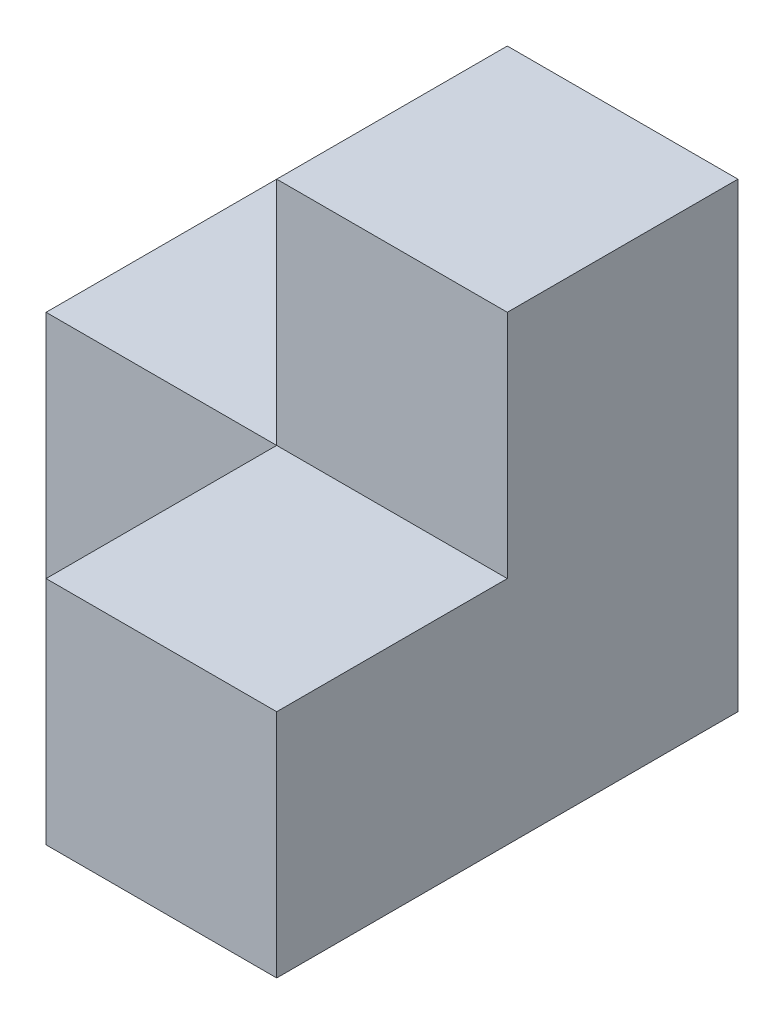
ISO-10303-21;
HEADER;
FILE_DESCRIPTION(('STEP AP214'),'2;1');
FILE_NAME('part.step','',(''),(''),'','','');
FILE_SCHEMA(('AUTOMOTIVE_DESIGN { 1 0 10303 214 1 1 1 1 }'));
ENDSEC;
DATA;
#1=APPLICATION_CONTEXT('core data for automotive mechanical design processes');
#2=APPLICATION_PROTOCOL_DEFINITION('international standard','automotive_design',2000,#1);
#3=PRODUCT_CONTEXT('',#1,'mechanical');
#4=PRODUCT('Part','Part','',(#3));
#5=PRODUCT_RELATED_PRODUCT_CATEGORY('part','',(#4));
#6=PRODUCT_DEFINITION_FORMATION('','',#4);
#7=PRODUCT_DEFINITION_CONTEXT('part definition',#1,'design');
#8=PRODUCT_DEFINITION('design','',#6,#7);
#9=PRODUCT_DEFINITION_SHAPE('','',#8);
#10=(LENGTH_UNIT() NAMED_UNIT(*) SI_UNIT(.MILLI.,.METRE.));
#11=(NAMED_UNIT(*) PLANE_ANGLE_UNIT() SI_UNIT($,.RADIAN.));
#12=(NAMED_UNIT(*) SI_UNIT($,.STERADIAN.) SOLID_ANGLE_UNIT());
#13=UNCERTAINTY_MEASURE_WITH_UNIT(LENGTH_MEASURE(1.E-05),#10,'distance_accuracy_value','');
#14=(GEOMETRIC_REPRESENTATION_CONTEXT(3) GLOBAL_UNCERTAINTY_ASSIGNED_CONTEXT((#13)) GLOBAL_UNIT_ASSIGNED_CONTEXT((#10,
#11,#12)) REPRESENTATION_CONTEXT('',''));
#15=CARTESIAN_POINT('',(0.,0.,0.));
#16=DIRECTION('',(0.,0.,1.));
#17=DIRECTION('',(1.,0.,0.));
#18=AXIS2_PLACEMENT_3D('',#15,#16,#17);
#19=CARTESIAN_POINT('',(0.,76.2,0.));
#20=DIRECTION('',(0.,1.,0.));
#21=DIRECTION('',(0.,0.,1.));
#22=AXIS2_PLACEMENT_3D('',#19,#20,#21);
#23=PLANE('',#22);
#24=DIRECTION('',(1.,0.,0.));
#25=VECTOR('',#24,1.);
#26=CARTESIAN_POINT('',(0.,76.2,76.2));
#27=LINE('',#26,#25);
#28=CARTESIAN_POINT('',(-76.2,76.2,76.2));
#29=VERTEX_POINT('',#28);
#30=CARTESIAN_POINT('',(0.,76.2,76.2000000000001));
#31=VERTEX_POINT('',#30);
#32=EDGE_CURVE('E127',#29,#31,#27,.T.);
#33=ORIENTED_EDGE('',*,*,#32,.F.);
#34=DIRECTION('',(0.,0.,1.));
#35=VECTOR('',#34,1.);
#36=CARTESIAN_POINT('',(-76.2,76.2,76.2));
#37=LINE('',#36,#35);
#38=CARTESIAN_POINT('',(-76.2,76.2,152.4));
#39=VERTEX_POINT('',#38);
#40=EDGE_CURVE('E161',#29,#39,#37,.T.);
#41=ORIENTED_EDGE('',*,*,#40,.T.);
#42=DIRECTION('',(1.,0.,0.));
#43=VECTOR('',#42,1.);
#44=CARTESIAN_POINT('',(-76.2,76.2,152.4));
#45=LINE('',#44,#43);
#46=CARTESIAN_POINT('',(0.,76.2,152.4));
#47=VERTEX_POINT('',#46);
#48=EDGE_CURVE('E163',#39,#47,#45,.T.);
#49=ORIENTED_EDGE('',*,*,#48,.T.);
#50=DIRECTION('',(0.,0.,-1.));
#51=VECTOR('',#50,1.);
#52=CARTESIAN_POINT('',(0.,76.2,152.4));
#53=LINE('',#52,#51);
#54=EDGE_CURVE('E59',#47,#31,#53,.T.);
#55=ORIENTED_EDGE('',*,*,#54,.T.);
#56=EDGE_LOOP('',(#33,#41,#49,#55));
#57=FACE_BOUND('',#56,.T.);
#58=ADVANCED_FACE('F34',(#57),#23,.T.);
#59=CARTESIAN_POINT('',(0.,76.2,152.4));
#60=DIRECTION('',(-1.,0.,0.));
#61=DIRECTION('',(0.,0.,1.));
#62=AXIS2_PLACEMENT_3D('',#59,#60,#61);
#63=PLANE('',#62);
#64=DIRECTION('',(0.,0.,-1.));
#65=VECTOR('',#64,1.);
#66=CARTESIAN_POINT('',(0.,0.,152.4));
#67=LINE('',#66,#65);
#68=CARTESIAN_POINT('',(0.,0.,152.4));
#69=VERTEX_POINT('',#68);
#70=CARTESIAN_POINT('',(0.,0.,0.));
#71=VERTEX_POINT('',#70);
#72=EDGE_CURVE('E112',#69,#71,#67,.T.);
#73=ORIENTED_EDGE('',*,*,#72,.T.);
#74=DIRECTION('',(0.,-1.,0.));
#75=VECTOR('',#74,1.);
#76=CARTESIAN_POINT('',(0.,76.2,0.));
#77=LINE('',#76,#75);
#78=CARTESIAN_POINT('',(0.,152.4,0.));
#79=VERTEX_POINT('',#78);
#80=EDGE_CURVE('E11',#79,#71,#77,.T.);
#81=ORIENTED_EDGE('',*,*,#80,.F.);
#82=DIRECTION('',(0.,0.,-1.));
#83=VECTOR('',#82,1.);
#84=CARTESIAN_POINT('',(0.,152.4,0.));
#85=LINE('',#84,#83);
#86=CARTESIAN_POINT('',(0.,152.4,76.2));
#87=VERTEX_POINT('',#86);
#88=EDGE_CURVE('E109',#87,#79,#85,.T.);
#89=ORIENTED_EDGE('',*,*,#88,.F.);
#90=DIRECTION('',(0.,-1.,0.));
#91=VECTOR('',#90,1.);
#92=CARTESIAN_POINT('',(0.,152.4,76.2));
#93=LINE('',#92,#91);
#94=EDGE_CURVE('E133',#87,#31,#93,.T.);
#95=ORIENTED_EDGE('',*,*,#94,.T.);
#96=ORIENTED_EDGE('',*,*,#54,.F.);
#97=DIRECTION('',(0.,-1.,0.));
#98=VECTOR('',#97,1.);
#99=CARTESIAN_POINT('',(0.,76.2,152.4));
#100=LINE('',#99,#98);
#101=EDGE_CURVE('E164',#47,#69,#100,.T.);
#102=ORIENTED_EDGE('',*,*,#101,.T.);
#103=EDGE_LOOP('',(#73,#81,#89,#95,#96,#102));
#104=FACE_BOUND('',#103,.T.);
#105=ADVANCED_FACE('F36',(#104),#63,.F.);
#106=CARTESIAN_POINT('',(0.,76.2,0.));
#107=DIRECTION('',(0.,0.,1.));
#108=DIRECTION('',(1.,0.,0.));
#109=AXIS2_PLACEMENT_3D('',#106,#107,#108);
#110=PLANE('',#109);
#111=DIRECTION('',(-1.,0.,0.));
#112=VECTOR('',#111,1.);
#113=CARTESIAN_POINT('',(0.,0.,0.));
#114=LINE('',#113,#112);
#115=CARTESIAN_POINT('',(-152.4,0.,0.));
#116=VERTEX_POINT('',#115);
#117=EDGE_CURVE('E145',#71,#116,#114,.T.);
#118=ORIENTED_EDGE('',*,*,#117,.T.);
#119=DIRECTION('',(0.,-1.,0.));
#120=VECTOR('',#119,1.);
#121=CARTESIAN_POINT('',(-152.4,76.2,0.));
#122=LINE('',#121,#120);
#123=CARTESIAN_POINT('',(-152.4,76.2,0.));
#124=VERTEX_POINT('',#123);
#125=EDGE_CURVE('E43',#124,#116,#122,.T.);
#126=ORIENTED_EDGE('',*,*,#125,.F.);
#127=DIRECTION('',(-1.,0.,0.));
#128=VECTOR('',#127,1.);
#129=CARTESIAN_POINT('',(0.,76.2,0.));
#130=LINE('',#129,#128);
#131=CARTESIAN_POINT('',(-76.1999999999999,76.2,0.));
#132=VERTEX_POINT('',#131);
#133=EDGE_CURVE('E151',#132,#124,#130,.T.);
#134=ORIENTED_EDGE('',*,*,#133,.F.);
#135=DIRECTION('',(0.,-1.,0.));
#136=VECTOR('',#135,1.);
#137=CARTESIAN_POINT('',(-76.2,152.4,0.));
#138=LINE('',#137,#136);
#139=CARTESIAN_POINT('',(-76.2,152.4,0.));
#140=VERTEX_POINT('',#139);
#141=EDGE_CURVE('E118',#140,#132,#138,.T.);
#142=ORIENTED_EDGE('',*,*,#141,.F.);
#143=DIRECTION('',(-1.,0.,0.));
#144=VECTOR('',#143,1.);
#145=CARTESIAN_POINT('',(0.,152.4,0.));
#146=LINE('',#145,#144);
#147=EDGE_CURVE('E115',#79,#140,#146,.T.);
#148=ORIENTED_EDGE('',*,*,#147,.F.);
#149=ORIENTED_EDGE('',*,*,#80,.T.);
#150=EDGE_LOOP('',(#118,#126,#134,#142,#148,#149));
#151=FACE_BOUND('',#150,.T.);
#152=ADVANCED_FACE('F116',(#151),#110,.F.);
#153=CARTESIAN_POINT('',(-152.4,76.2,0.));
#154=DIRECTION('',(1.,0.,0.));
#155=DIRECTION('',(0.,0.,-1.));
#156=AXIS2_PLACEMENT_3D('',#153,#154,#155);
#157=PLANE('',#156);
#158=DIRECTION('',(0.,0.,1.));
#159=VECTOR('',#158,1.);
#160=CARTESIAN_POINT('',(-152.4,0.,0.));
#161=LINE('',#160,#159);
#162=CARTESIAN_POINT('',(-152.4,0.,76.2));
#163=VERTEX_POINT('',#162);
#164=EDGE_CURVE('E167',#116,#163,#161,.T.);
#165=ORIENTED_EDGE('',*,*,#164,.T.);
#166=DIRECTION('',(0.,-1.,0.));
#167=VECTOR('',#166,1.);
#168=CARTESIAN_POINT('',(-152.4,76.2,76.2));
#169=LINE('',#168,#167);
#170=CARTESIAN_POINT('',(-152.4,76.2,76.2));
#171=VERTEX_POINT('',#170);
#172=EDGE_CURVE('E182',#171,#163,#169,.T.);
#173=ORIENTED_EDGE('',*,*,#172,.F.);
#174=DIRECTION('',(0.,0.,1.));
#175=VECTOR('',#174,1.);
#176=CARTESIAN_POINT('',(-152.4,76.2,0.));
#177=LINE('',#176,#175);
#178=EDGE_CURVE('E154',#124,#171,#177,.T.);
#179=ORIENTED_EDGE('',*,*,#178,.F.);
#180=ORIENTED_EDGE('',*,*,#125,.T.);
#181=EDGE_LOOP('',(#165,#173,#179,#180));
#182=FACE_BOUND('',#181,.T.);
#183=ADVANCED_FACE('F190',(#182),#157,.F.);
#184=CARTESIAN_POINT('',(-152.4,76.2,76.2));
#185=DIRECTION('',(0.,0.,-1.));
#186=DIRECTION('',(-1.,0.,0.));
#187=AXIS2_PLACEMENT_3D('',#184,#185,#186);
#188=PLANE('',#187);
#189=DIRECTION('',(1.,0.,0.));
#190=VECTOR('',#189,1.);
#191=CARTESIAN_POINT('',(-152.4,0.,76.2));
#192=LINE('',#191,#190);
#193=CARTESIAN_POINT('',(-76.2,0.,76.2));
#194=VERTEX_POINT('',#193);
#195=EDGE_CURVE('E169',#163,#194,#192,.T.);
#196=ORIENTED_EDGE('',*,*,#195,.T.);
#197=DIRECTION('',(0.,-1.,0.));
#198=VECTOR('',#197,1.);
#199=CARTESIAN_POINT('',(-76.2,76.2,76.2));
#200=LINE('',#199,#198);
#201=EDGE_CURVE('E179',#29,#194,#200,.T.);
#202=ORIENTED_EDGE('',*,*,#201,.F.);
#203=DIRECTION('',(1.,0.,0.));
#204=VECTOR('',#203,1.);
#205=CARTESIAN_POINT('',(-152.4,76.2,76.2));
#206=LINE('',#205,#204);
#207=EDGE_CURVE('E159',#171,#29,#206,.T.);
#208=ORIENTED_EDGE('',*,*,#207,.F.);
#209=ORIENTED_EDGE('',*,*,#172,.T.);
#210=EDGE_LOOP('',(#196,#202,#208,#209));
#211=FACE_BOUND('',#210,.T.);
#212=ADVANCED_FACE('F199',(#211),#188,.F.);
#213=CARTESIAN_POINT('',(-76.2,76.2,76.2));
#214=DIRECTION('',(1.,0.,0.));
#215=DIRECTION('',(0.,0.,-1.));
#216=AXIS2_PLACEMENT_3D('',#213,#214,#215);
#217=PLANE('',#216);
#218=DIRECTION('',(0.,0.,1.));
#219=VECTOR('',#218,1.);
#220=CARTESIAN_POINT('',(-76.2,0.,76.2));
#221=LINE('',#220,#219);
#222=CARTESIAN_POINT('',(-76.2,0.,152.4));
#223=VERTEX_POINT('',#222);
#224=EDGE_CURVE('E171',#194,#223,#221,.T.);
#225=ORIENTED_EDGE('',*,*,#224,.T.);
#226=DIRECTION('',(0.,-1.,0.));
#227=VECTOR('',#226,1.);
#228=CARTESIAN_POINT('',(-76.2,76.2,152.4));
#229=LINE('',#228,#227);
#230=EDGE_CURVE('E176',#39,#223,#229,.T.);
#231=ORIENTED_EDGE('',*,*,#230,.F.);
#232=ORIENTED_EDGE('',*,*,#40,.F.);
#233=ORIENTED_EDGE('',*,*,#201,.T.);
#234=EDGE_LOOP('',(#225,#231,#232,#233));
#235=FACE_BOUND('',#234,.T.);
#236=ADVANCED_FACE('F202',(#235),#217,.F.);
#237=CARTESIAN_POINT('',(-76.2,76.2,152.4));
#238=DIRECTION('',(0.,0.,-1.));
#239=DIRECTION('',(-1.,0.,0.));
#240=AXIS2_PLACEMENT_3D('',#237,#238,#239);
#241=PLANE('',#240);
#242=DIRECTION('',(1.,0.,0.));
#243=VECTOR('',#242,1.);
#244=CARTESIAN_POINT('',(-76.2,0.,152.4));
#245=LINE('',#244,#243);
#246=EDGE_CURVE('E173',#223,#69,#245,.T.);
#247=ORIENTED_EDGE('',*,*,#246,.T.);
#248=ORIENTED_EDGE('',*,*,#101,.F.);
#249=ORIENTED_EDGE('',*,*,#48,.F.);
#250=ORIENTED_EDGE('',*,*,#230,.T.);
#251=EDGE_LOOP('',(#247,#248,#249,#250));
#252=FACE_BOUND('',#251,.T.);
#253=ADVANCED_FACE('F224',(#252),#241,.F.);
#254=DIRECTION('',(0.,0.,1.));
#255=VECTOR('',#254,1.);
#256=CARTESIAN_POINT('',(-76.2,76.2,0.));
#257=LINE('',#256,#255);
#258=EDGE_CURVE('E51',#132,#29,#257,.T.);
#259=ORIENTED_EDGE('',*,*,#258,.F.);
#260=ORIENTED_EDGE('',*,*,#133,.T.);
#261=ORIENTED_EDGE('',*,*,#178,.T.);
#262=ORIENTED_EDGE('',*,*,#207,.T.);
#263=EDGE_LOOP('',(#259,#260,#261,#262));
#264=FACE_BOUND('',#263,.T.);
#265=ADVANCED_FACE('F218',(#264),#23,.T.);
#266=CARTESIAN_POINT('',(0.,0.,0.));
#267=DIRECTION('',(0.,1.,0.));
#268=DIRECTION('',(0.,0.,1.));
#269=AXIS2_PLACEMENT_3D('',#266,#267,#268);
#270=PLANE('',#269);
#271=ORIENTED_EDGE('',*,*,#72,.F.);
#272=ORIENTED_EDGE('',*,*,#246,.F.);
#273=ORIENTED_EDGE('',*,*,#224,.F.);
#274=ORIENTED_EDGE('',*,*,#195,.F.);
#275=ORIENTED_EDGE('',*,*,#164,.F.);
#276=ORIENTED_EDGE('',*,*,#117,.F.);
#277=EDGE_LOOP('',(#271,#272,#273,#274,#275,#276));
#278=FACE_BOUND('',#277,.T.);
#279=ADVANCED_FACE('F194',(#278),#270,.F.);
#280=CARTESIAN_POINT('',(-76.2,152.4,0.));
#281=DIRECTION('',(1.,0.,0.));
#282=DIRECTION('',(0.,0.,-1.));
#283=AXIS2_PLACEMENT_3D('',#280,#281,#282);
#284=PLANE('',#283);
#285=ORIENTED_EDGE('',*,*,#258,.T.);
#286=DIRECTION('',(0.,-1.,0.));
#287=VECTOR('',#286,1.);
#288=CARTESIAN_POINT('',(-76.2,152.4,76.2));
#289=LINE('',#288,#287);
#290=CARTESIAN_POINT('',(-76.2,152.4,76.2));
#291=VERTEX_POINT('',#290);
#292=EDGE_CURVE('E136',#291,#29,#289,.T.);
#293=ORIENTED_EDGE('',*,*,#292,.F.);
#294=DIRECTION('',(0.,0.,1.));
#295=VECTOR('',#294,1.);
#296=CARTESIAN_POINT('',(-76.2,152.4,0.));
#297=LINE('',#296,#295);
#298=EDGE_CURVE('E121',#140,#291,#297,.T.);
#299=ORIENTED_EDGE('',*,*,#298,.F.);
#300=ORIENTED_EDGE('',*,*,#141,.T.);
#301=EDGE_LOOP('',(#285,#293,#299,#300));
#302=FACE_BOUND('',#301,.T.);
#303=ADVANCED_FACE('F206',(#302),#284,.F.);
#304=CARTESIAN_POINT('',(0.,152.4,76.2));
#305=DIRECTION('',(0.,0.,-1.));
#306=DIRECTION('',(-1.,0.,0.));
#307=AXIS2_PLACEMENT_3D('',#304,#305,#306);
#308=PLANE('',#307);
#309=ORIENTED_EDGE('',*,*,#32,.T.);
#310=ORIENTED_EDGE('',*,*,#94,.F.);
#311=DIRECTION('',(1.,0.,0.));
#312=VECTOR('',#311,1.);
#313=CARTESIAN_POINT('',(0.,152.4,76.2));
#314=LINE('',#313,#312);
#315=EDGE_CURVE('E125',#291,#87,#314,.T.);
#316=ORIENTED_EDGE('',*,*,#315,.F.);
#317=ORIENTED_EDGE('',*,*,#292,.T.);
#318=EDGE_LOOP('',(#309,#310,#316,#317));
#319=FACE_BOUND('',#318,.T.);
#320=ADVANCED_FACE('F207',(#319),#308,.F.);
#321=CARTESIAN_POINT('',(0.,152.4,0.));
#322=DIRECTION('',(0.,-1.,0.));
#323=DIRECTION('',(0.,0.,-1.));
#324=AXIS2_PLACEMENT_3D('',#321,#322,#323);
#325=PLANE('',#324);
#326=ORIENTED_EDGE('',*,*,#88,.T.);
#327=ORIENTED_EDGE('',*,*,#147,.T.);
#328=ORIENTED_EDGE('',*,*,#298,.T.);
#329=ORIENTED_EDGE('',*,*,#315,.T.);
#330=EDGE_LOOP('',(#326,#327,#328,#329));
#331=FACE_BOUND('',#330,.T.);
#332=ADVANCED_FACE('F123',(#331),#325,.F.);
#333=CLOSED_SHELL('',(#58,#105,#152,#183,#212,#236,#253,#265,#279,#303,#320,#332));
#334=MANIFOLD_SOLID_BREP('B2',#333);
#335=ADVANCED_BREP_SHAPE_REPRESENTATION('',(#18,#334),#14);
#336=SHAPE_DEFINITION_REPRESENTATION(#9,#335);
ENDSEC;
END-ISO-10303-21;
